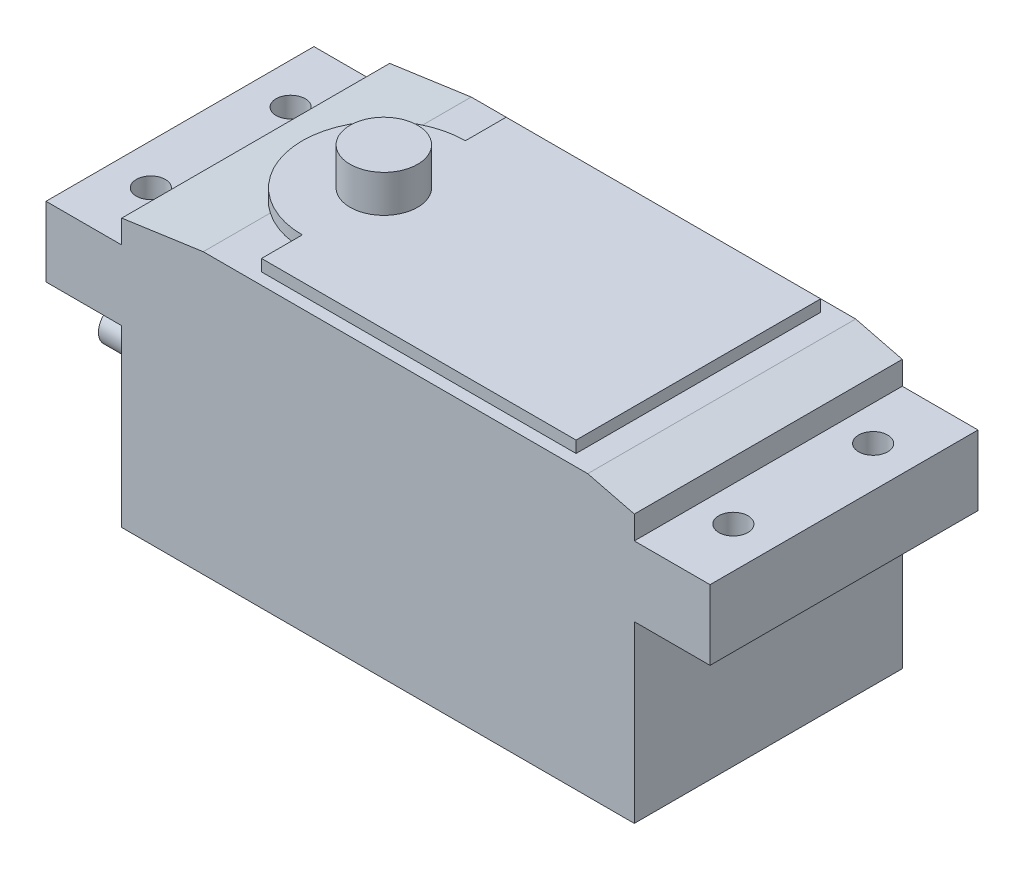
from build123d import *

# Parameters (mm, degrees)
EXTRUSION1_DEPTH        = 23
ESQUISSE2_R             = 1.25
ENL_V_MAT_EXTRU_1_DEPTH = 60.331694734
EXTRUSION5_DEPTH        = 0.5
EXTRUSION6_DEPTH        = 10
EXTRUSION7_DEPTH        = 61.458663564
EXTRUSION8_DEPTH        = 1
EXTRUSION8_DEPTH_BACK   = 1
ESQUISSE10_R            = 2.9
EXTRUSION9_DEPTH        = 3.2


with BuildPart() as part:
    # Esquisse1 → Extrusion1 (new body)
    with BuildSketch(Plane.XY):
        Polygon((50.5, 21), (44, 21), (44, 24), (0, 24), (0, 21), (-6.5, 21), (-6.5, 15), (0, 15), (0, 0), (44, 0), (44, 15), (50.5, 15), align=None)
    extrude(amount=EXTRUSION1_DEPTH)

    # Esquisse2 → Enl_v. mat.-Extru.1 (cut, through all)
    with BuildSketch(Plane(origin=(0, 21, 0), x_dir=(1, 0, 0), z_dir=(0, 1, 0))):
        with Locations(Location((-3, -5.5, 0), (0, 0, 270))):
            Circle(ESQUISSE2_R)
        with Locations(Location((-3, -17.5, 0), (0, 0, 270))):
            Circle(ESQUISSE2_R)
        with Locations(Location((47, -17.5, 0), (0, 0, 270))):
            Circle(ESQUISSE2_R)
        with Locations(Location((47, -5.5, 0), (0, 0, 270))):
            Circle(ESQUISSE2_R)
    extrude(amount=-ENL_V_MAT_EXTRU_1_DEPTH, mode=Mode.SUBTRACT)

    # Esquisse6 → Extrusion5 (add)
    with BuildSketch(Plane.ZY):
        with BuildLine():
            Line((10, 7), (13, 7))
            ThreePointArc((13, 7), (15, 5), (13, 3))
            Line((13, 3), (10, 3))
            ThreePointArc((10, 3), (8, 5), (10, 7))
        make_face()
    extrude(amount=EXTRUSION5_DEPTH)

    # Esquisse7 → Extrusion6 (add)
    with BuildSketch(Plane.ZY.offset(0.5)):
        with BuildLine():
            Line((10, 3.5), (13, 3.5))
            ThreePointArc((13, 3.5), (14.5, 5), (13, 6.5))
            Line((13, 6.5), (10, 6.5))
            ThreePointArc((10, 6.5), (8.5, 5), (10, 3.5))
        make_face()
    extrude(amount=EXTRUSION6_DEPTH)

    # Esquisse8 → Extrusion7 (cut, through all)
    with BuildSketch(Plane.XY.offset(23)):
        Polygon((44, 23), (44, 24), (40, 24), align=None)
        Polygon((0, 24), (0, 23), (7, 24), align=None)
    extrude(amount=-EXTRUSION7_DEPTH, mode=Mode.SUBTRACT)

    # Esquisse9 → Extrusion8 (add, two sides: drawn at the far end of the back side and taken through both)
    with BuildSketch(Plane(origin=(0, 24, 0), x_dir=(1, 0, 0), z_dir=(0, 1, 0)).offset(-EXTRUSION8_DEPTH_BACK)):
        with BuildLine():
            Line((11, -1), (11, -4.5))
            ThreePointArc((11, -4.5), (4, -11.5), (11, -18.5))
            Line((11, -18.5), (11, -22))
            Line((11, -22), (38, -22))
            Line((38, -22), (38, -1))
            Line((38, -1), (11, -1))
        make_face()
    extrude(amount=EXTRUSION8_DEPTH + EXTRUSION8_DEPTH_BACK)

    # Esquisse10 → Extrusion9 (add)
    with BuildSketch(Plane(origin=(0, 25, 0), x_dir=(1, 0, 0), z_dir=(0, 1, 0))):
        with Locations(Location((11, -11.5, 0), (0, 0, 270))):
            Circle(ESQUISSE10_R)
    extrude(amount=EXTRUSION9_DEPTH)


solid = part.part
